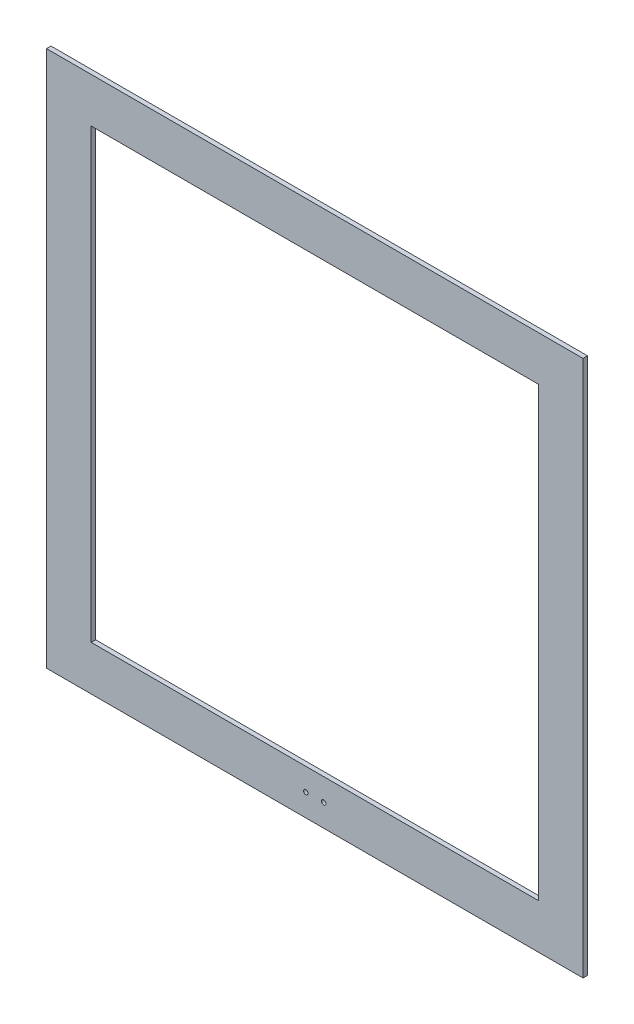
from build123d import *

# Parameters (mm, degrees)
ESQUISSE1_W             = 600
ESQUISSE1_H             = 600
ESQUISSE1_W_2           = 500
ESQUISSE1_H_2           = 500
BOSS_EXTRU_1_DEPTH      = 5
ENL_V_MAT_EXTRU_1_REACH = 426.294
ESQUISSE2_R             = 2.5


with BuildPart() as part:
    # Esquisse1 → Boss.-Extru.1 (new body)
    with BuildSketch(Plane.XY):
        Rectangle(ESQUISSE1_W, ESQUISSE1_H)
        Rectangle(ESQUISSE1_W_2, ESQUISSE1_H_2, mode=Mode.SUBTRACT)
    extrude(amount=BOSS_EXTRU_1_DEPTH)

    # Esquisse2 → Enl_v. mat.-Extru.1 (cut, up to next)
    with BuildSketch(Plane.XY.offset(5), mode=Mode.PRIVATE) as enl_v_mat_extru_1_sk1:
        with Locations((-10, -275)):
            Circle(ESQUISSE2_R)
    enl_v_mat_extru_1_tool1 = extrude(enl_v_mat_extru_1_sk1.sketch, amount=-ENL_V_MAT_EXTRU_1_REACH, mode=Mode.PRIVATE) & part.part
    # Esquisse2 → Enl_v. mat.-Extru.1 (cut, up to next)
    with BuildSketch(Plane.XY.offset(5), mode=Mode.PRIVATE) as enl_v_mat_extru_1_sk2:
        with Locations((10, -275)):
            Circle(ESQUISSE2_R)
    enl_v_mat_extru_1_tool2 = extrude(enl_v_mat_extru_1_sk2.sketch, amount=-ENL_V_MAT_EXTRU_1_REACH, mode=Mode.PRIVATE) & part.part
    add(enl_v_mat_extru_1_tool1.solids().sort_by_distance((-10, -275, 5))[0], mode=Mode.SUBTRACT)
    add(enl_v_mat_extru_1_tool2.solids().sort_by_distance((10, -275, 5))[0], mode=Mode.SUBTRACT)


solid = part.part
